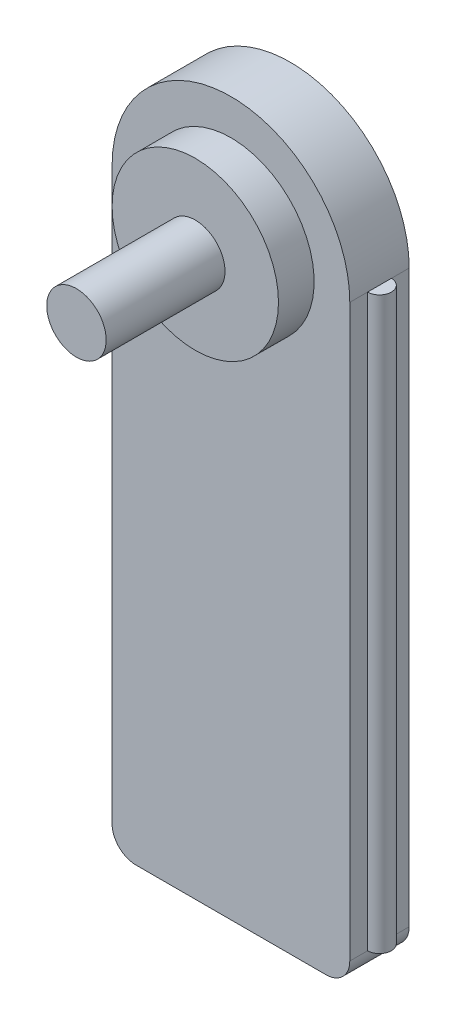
ISO-10303-21;
HEADER;
FILE_DESCRIPTION(('STEP AP214'),'2;1');
FILE_NAME('part.step','',(''),(''),'','','');
FILE_SCHEMA(('AUTOMOTIVE_DESIGN { 1 0 10303 214 1 1 1 1 }'));
ENDSEC;
DATA;
#1=APPLICATION_CONTEXT('core data for automotive mechanical design processes');
#2=APPLICATION_PROTOCOL_DEFINITION('international standard','automotive_design',2000,#1);
#3=PRODUCT_CONTEXT('',#1,'mechanical');
#4=PRODUCT('Part','Part','',(#3));
#5=PRODUCT_RELATED_PRODUCT_CATEGORY('part','',(#4));
#6=PRODUCT_DEFINITION_FORMATION('','',#4);
#7=PRODUCT_DEFINITION_CONTEXT('part definition',#1,'design');
#8=PRODUCT_DEFINITION('design','',#6,#7);
#9=PRODUCT_DEFINITION_SHAPE('','',#8);
#10=(LENGTH_UNIT() NAMED_UNIT(*) SI_UNIT(.MILLI.,.METRE.));
#11=(NAMED_UNIT(*) PLANE_ANGLE_UNIT() SI_UNIT($,.RADIAN.));
#12=(NAMED_UNIT(*) SI_UNIT($,.STERADIAN.) SOLID_ANGLE_UNIT());
#13=UNCERTAINTY_MEASURE_WITH_UNIT(LENGTH_MEASURE(1.E-05),#10,'distance_accuracy_value','');
#14=(GEOMETRIC_REPRESENTATION_CONTEXT(3) GLOBAL_UNCERTAINTY_ASSIGNED_CONTEXT((#13)) GLOBAL_UNIT_ASSIGNED_CONTEXT((#10,
#11,#12)) REPRESENTATION_CONTEXT('',''));
#15=CARTESIAN_POINT('',(0.,0.,0.));
#16=DIRECTION('',(0.,0.,1.));
#17=DIRECTION('',(1.,0.,0.));
#18=AXIS2_PLACEMENT_3D('',#15,#16,#17);
#19=CARTESIAN_POINT('',(-10.,0.,5.));
#20=DIRECTION('',(1.,0.,0.));
#21=DIRECTION('',(0.,1.,0.));
#22=AXIS2_PLACEMENT_3D('',#19,#20,#21);
#23=PLANE('',#22);
#24=DIRECTION('',(0.,1.,0.));
#25=VECTOR('',#24,1.);
#26=CARTESIAN_POINT('',(-9.99999999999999,-48.,1.5));
#27=LINE('',#26,#25);
#28=CARTESIAN_POINT('',(-10.,0.,1.5));
#29=VERTEX_POINT('',#28);
#30=CARTESIAN_POINT('',(-9.99999999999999,-48.,1.5));
#31=VERTEX_POINT('',#30);
#32=EDGE_CURVE('E11',#29,#31,#27,.F.);
#33=ORIENTED_EDGE('',*,*,#32,.F.);
#34=DIRECTION('',(0.,0.,-1.));
#35=VECTOR('',#34,1.);
#36=CARTESIAN_POINT('',(-10.,0.,5.));
#37=LINE('',#36,#35);
#38=CARTESIAN_POINT('',(-10.,0.,0.));
#39=VERTEX_POINT('',#38);
#40=EDGE_CURVE('E136',#29,#39,#37,.T.);
#41=ORIENTED_EDGE('',*,*,#40,.T.);
#42=DIRECTION('',(0.,-1.,0.));
#43=VECTOR('',#42,1.);
#44=CARTESIAN_POINT('',(-10.,0.,0.));
#45=LINE('',#44,#43);
#46=CARTESIAN_POINT('',(-9.99999999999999,-48.,0.));
#47=VERTEX_POINT('',#46);
#48=EDGE_CURVE('E171',#39,#47,#45,.T.);
#49=ORIENTED_EDGE('',*,*,#48,.T.);
#50=DIRECTION('',(0.,0.,-1.));
#51=VECTOR('',#50,1.);
#52=CARTESIAN_POINT('',(-9.99999999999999,-48.,5.));
#53=LINE('',#52,#51);
#54=EDGE_CURVE('E114',#31,#47,#53,.T.);
#55=ORIENTED_EDGE('',*,*,#54,.F.);
#56=EDGE_LOOP('',(#33,#41,#49,#55));
#57=FACE_BOUND('',#56,.T.);
#58=ADVANCED_FACE('F35',(#57),#23,.F.);
#59=DIRECTION('',(0.,1.,0.));
#60=VECTOR('',#59,1.);
#61=CARTESIAN_POINT('',(-9.99999999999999,-48.,3.5));
#62=LINE('',#61,#60);
#63=CARTESIAN_POINT('',(-9.99999999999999,-48.,3.5));
#64=VERTEX_POINT('',#63);
#65=CARTESIAN_POINT('',(-10.,0.,3.5));
#66=VERTEX_POINT('',#65);
#67=EDGE_CURVE('E43',#64,#66,#62,.T.);
#68=ORIENTED_EDGE('',*,*,#67,.F.);
#69=CARTESIAN_POINT('',(-9.99999999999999,-48.,5.));
#70=VERTEX_POINT('',#69);
#71=EDGE_CURVE('E113',#70,#64,#53,.T.);
#72=ORIENTED_EDGE('',*,*,#71,.F.);
#73=DIRECTION('',(0.,-1.,0.));
#74=VECTOR('',#73,1.);
#75=CARTESIAN_POINT('',(-10.,0.,5.));
#76=LINE('',#75,#74);
#77=CARTESIAN_POINT('',(-10.,0.,5.));
#78=VERTEX_POINT('',#77);
#79=EDGE_CURVE('E184',#78,#70,#76,.T.);
#80=ORIENTED_EDGE('',*,*,#79,.F.);
#81=EDGE_CURVE('E131',#78,#66,#37,.T.);
#82=ORIENTED_EDGE('',*,*,#81,.T.);
#83=EDGE_LOOP('',(#68,#72,#80,#82));
#84=FACE_BOUND('',#83,.T.);
#85=ADVANCED_FACE('F128',(#84),#23,.F.);
#86=CARTESIAN_POINT('',(10.,-48.,5.));
#87=DIRECTION('',(-1.,0.,0.));
#88=DIRECTION('',(0.,0.,1.));
#89=AXIS2_PLACEMENT_3D('',#86,#87,#88);
#90=PLANE('',#89);
#91=DIRECTION('',(0.,0.,-1.));
#92=VECTOR('',#91,1.);
#93=CARTESIAN_POINT('',(10.,-48.,5.));
#94=LINE('',#93,#92);
#95=CARTESIAN_POINT('',(10.,-48.,5.));
#96=VERTEX_POINT('',#95);
#97=CARTESIAN_POINT('',(10.,-48.,3.5));
#98=VERTEX_POINT('',#97);
#99=EDGE_CURVE('E148',#96,#98,#94,.T.);
#100=ORIENTED_EDGE('',*,*,#99,.T.);
#101=DIRECTION('',(0.,1.,0.));
#102=VECTOR('',#101,1.);
#103=CARTESIAN_POINT('',(10.,-48.,3.5));
#104=LINE('',#103,#102);
#105=CARTESIAN_POINT('',(10.,0.,3.5));
#106=VERTEX_POINT('',#105);
#107=EDGE_CURVE('E132',#98,#106,#104,.T.);
#108=ORIENTED_EDGE('',*,*,#107,.T.);
#109=DIRECTION('',(0.,0.,-1.));
#110=VECTOR('',#109,1.);
#111=CARTESIAN_POINT('',(10.,0.,5.));
#112=LINE('',#111,#110);
#113=CARTESIAN_POINT('',(10.,0.,5.));
#114=VERTEX_POINT('',#113);
#115=EDGE_CURVE('E155',#114,#106,#112,.T.);
#116=ORIENTED_EDGE('',*,*,#115,.F.);
#117=DIRECTION('',(0.,1.,0.));
#118=VECTOR('',#117,1.);
#119=CARTESIAN_POINT('',(10.,-48.,5.));
#120=LINE('',#119,#118);
#121=EDGE_CURVE('E177',#96,#114,#120,.T.);
#122=ORIENTED_EDGE('',*,*,#121,.F.);
#123=EDGE_LOOP('',(#100,#108,#116,#122));
#124=FACE_BOUND('',#123,.T.);
#125=ADVANCED_FACE('F233',(#124),#90,.F.);
#126=CARTESIAN_POINT('',(0.,0.,8.));
#127=DIRECTION('',(0.,0.,1.));
#128=DIRECTION('',(1.,0.,0.));
#129=AXIS2_PLACEMENT_3D('',#126,#127,#128);
#130=PLANE('',#129);
#131=CARTESIAN_POINT('',(0.,0.,8.));
#132=DIRECTION('',(0.,0.,1.));
#133=DIRECTION('',(1.,0.,0.));
#134=AXIS2_PLACEMENT_3D('',#131,#132,#133);
#135=CIRCLE('',#134,7.);
#136=CARTESIAN_POINT('',(7.,0.,8.));
#137=VERTEX_POINT('',#136);
#138=EDGE_CURVE('E176',#137,#137,#135,.T.);
#139=ORIENTED_EDGE('',*,*,#138,.T.);
#140=EDGE_LOOP('',(#139));
#141=FACE_BOUND('',#140,.T.);
#142=CARTESIAN_POINT('',(0.,0.,8.));
#143=DIRECTION('',(0.,0.,1.));
#144=DIRECTION('',(1.,0.,0.));
#145=AXIS2_PLACEMENT_3D('',#142,#143,#144);
#146=CIRCLE('',#145,2.5);
#147=CARTESIAN_POINT('',(2.5,0.,8.));
#148=VERTEX_POINT('',#147);
#149=EDGE_CURVE('E191',#148,#148,#146,.T.);
#150=ORIENTED_EDGE('',*,*,#149,.F.);
#151=EDGE_LOOP('',(#150));
#152=FACE_BOUND('',#151,.T.);
#153=ADVANCED_FACE('F275',(#141,#152),#130,.T.);
#154=CARTESIAN_POINT('',(0.,0.,5.));
#155=DIRECTION('',(0.,0.,-1.));
#156=DIRECTION('',(-1.,0.,0.));
#157=AXIS2_PLACEMENT_3D('',#154,#155,#156);
#158=PLANE('',#157);
#159=CARTESIAN_POINT('',(0.,0.,5.));
#160=DIRECTION('',(0.,0.,1.));
#161=DIRECTION('',(-1.,0.,0.));
#162=AXIS2_PLACEMENT_3D('',#159,#160,#161);
#163=CIRCLE('',#162,10.);
#164=EDGE_CURVE('E163',#114,#78,#163,.T.);
#165=ORIENTED_EDGE('',*,*,#164,.T.);
#166=ORIENTED_EDGE('',*,*,#79,.T.);
#167=CARTESIAN_POINT('',(-7.99999999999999,-48.,5.));
#168=DIRECTION('',(0.,0.,1.));
#169=DIRECTION('',(1.,0.,0.));
#170=AXIS2_PLACEMENT_3D('',#167,#168,#169);
#171=CIRCLE('',#170,2.);
#172=CARTESIAN_POINT('',(-7.99999999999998,-50.,5.));
#173=VERTEX_POINT('',#172);
#174=EDGE_CURVE('E135',#70,#173,#171,.T.);
#175=ORIENTED_EDGE('',*,*,#174,.T.);
#176=DIRECTION('',(1.,0.,0.));
#177=VECTOR('',#176,1.);
#178=CARTESIAN_POINT('',(-7.99999999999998,-50.,5.));
#179=LINE('',#178,#177);
#180=CARTESIAN_POINT('',(7.99999999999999,-50.,5.));
#181=VERTEX_POINT('',#180);
#182=EDGE_CURVE('E181',#173,#181,#179,.T.);
#183=ORIENTED_EDGE('',*,*,#182,.T.);
#184=CARTESIAN_POINT('',(8.,-48.,5.));
#185=DIRECTION('',(0.,0.,1.));
#186=DIRECTION('',(1.,0.,0.));
#187=AXIS2_PLACEMENT_3D('',#184,#185,#186);
#188=CIRCLE('',#187,2.);
#189=EDGE_CURVE('E179',#181,#96,#188,.T.);
#190=ORIENTED_EDGE('',*,*,#189,.T.);
#191=ORIENTED_EDGE('',*,*,#121,.T.);
#192=EDGE_LOOP('',(#165,#166,#175,#183,#190,#191));
#193=FACE_BOUND('',#192,.T.);
#194=CARTESIAN_POINT('',(0.,0.,5.));
#195=DIRECTION('',(0.,0.,-1.));
#196=DIRECTION('',(-1.,0.,0.));
#197=AXIS2_PLACEMENT_3D('',#194,#195,#196);
#198=CIRCLE('',#197,7.);
#199=CARTESIAN_POINT('',(-7.,0.,5.));
#200=VERTEX_POINT('',#199);
#201=EDGE_CURVE('E224',#200,#200,#198,.F.);
#202=ORIENTED_EDGE('',*,*,#201,.F.);
#203=EDGE_LOOP('',(#202));
#204=FACE_BOUND('',#203,.T.);
#205=ADVANCED_FACE('F218',(#193,#204),#158,.F.);
#206=CARTESIAN_POINT('',(0.,0.,5.));
#207=DIRECTION('',(0.,0.,-1.));
#208=DIRECTION('',(-1.,0.,0.));
#209=AXIS2_PLACEMENT_3D('',#206,#207,#208);
#210=CYLINDRICAL_SURFACE('',#209,10.);
#211=CARTESIAN_POINT('',(0.,0.,0.));
#212=DIRECTION('',(0.,0.,1.));
#213=DIRECTION('',(-1.,0.,0.));
#214=AXIS2_PLACEMENT_3D('',#211,#212,#213);
#215=CIRCLE('',#214,10.);
#216=CARTESIAN_POINT('',(10.,0.,0.));
#217=VERTEX_POINT('',#216);
#218=EDGE_CURVE('E173',#217,#39,#215,.T.);
#219=ORIENTED_EDGE('',*,*,#218,.T.);
#220=ORIENTED_EDGE('',*,*,#40,.F.);
#221=EDGE_CURVE('E137',#66,#29,#37,.T.);
#222=ORIENTED_EDGE('',*,*,#221,.F.);
#223=ORIENTED_EDGE('',*,*,#81,.F.);
#224=ORIENTED_EDGE('',*,*,#164,.F.);
#225=ORIENTED_EDGE('',*,*,#115,.T.);
#226=CARTESIAN_POINT('',(10.,0.,1.5));
#227=VERTEX_POINT('',#226);
#228=EDGE_CURVE('E158',#106,#227,#112,.T.);
#229=ORIENTED_EDGE('',*,*,#228,.T.);
#230=EDGE_CURVE('E159',#227,#217,#112,.T.);
#231=ORIENTED_EDGE('',*,*,#230,.T.);
#232=EDGE_LOOP('',(#219,#220,#222,#223,#224,#225,#229,#231));
#233=FACE_BOUND('',#232,.T.);
#234=ADVANCED_FACE('F37',(#233),#210,.T.);
#235=CARTESIAN_POINT('',(-7.99999999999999,-48.,5.));
#236=DIRECTION('',(0.,0.,-1.));
#237=DIRECTION('',(-1.,0.,0.));
#238=AXIS2_PLACEMENT_3D('',#235,#236,#237);
#239=CYLINDRICAL_SURFACE('',#238,2.);
#240=CARTESIAN_POINT('',(-7.99999999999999,-48.,0.));
#241=DIRECTION('',(0.,0.,1.));
#242=DIRECTION('',(1.,0.,0.));
#243=AXIS2_PLACEMENT_3D('',#240,#241,#242);
#244=CIRCLE('',#243,2.);
#245=CARTESIAN_POINT('',(-7.99999999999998,-50.,0.));
#246=VERTEX_POINT('',#245);
#247=EDGE_CURVE('E169',#47,#246,#244,.T.);
#248=ORIENTED_EDGE('',*,*,#247,.T.);
#249=DIRECTION('',(0.,0.,-1.));
#250=VECTOR('',#249,1.);
#251=CARTESIAN_POINT('',(-7.99999999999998,-50.,5.));
#252=LINE('',#251,#250);
#253=EDGE_CURVE('E140',#173,#246,#252,.T.);
#254=ORIENTED_EDGE('',*,*,#253,.F.);
#255=ORIENTED_EDGE('',*,*,#174,.F.);
#256=ORIENTED_EDGE('',*,*,#71,.T.);
#257=EDGE_CURVE('E109',#64,#31,#53,.T.);
#258=ORIENTED_EDGE('',*,*,#257,.T.);
#259=ORIENTED_EDGE('',*,*,#54,.T.);
#260=EDGE_LOOP('',(#248,#254,#255,#256,#258,#259));
#261=FACE_BOUND('',#260,.T.);
#262=ADVANCED_FACE('F133',(#261),#239,.T.);
#263=CARTESIAN_POINT('',(-7.99999999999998,-50.,5.));
#264=DIRECTION('',(0.,1.,0.));
#265=DIRECTION('',(0.,0.,1.));
#266=AXIS2_PLACEMENT_3D('',#263,#264,#265);
#267=PLANE('',#266);
#268=DIRECTION('',(1.,0.,0.));
#269=VECTOR('',#268,1.);
#270=CARTESIAN_POINT('',(-7.99999999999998,-50.,0.));
#271=LINE('',#270,#269);
#272=CARTESIAN_POINT('',(7.99999999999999,-50.,0.));
#273=VERTEX_POINT('',#272);
#274=EDGE_CURVE('E167',#246,#273,#271,.T.);
#275=ORIENTED_EDGE('',*,*,#274,.T.);
#276=DIRECTION('',(0.,0.,-1.));
#277=VECTOR('',#276,1.);
#278=CARTESIAN_POINT('',(7.99999999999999,-50.,5.));
#279=LINE('',#278,#277);
#280=EDGE_CURVE('E143',#181,#273,#279,.T.);
#281=ORIENTED_EDGE('',*,*,#280,.F.);
#282=ORIENTED_EDGE('',*,*,#182,.F.);
#283=ORIENTED_EDGE('',*,*,#253,.T.);
#284=EDGE_LOOP('',(#275,#281,#282,#283));
#285=FACE_BOUND('',#284,.T.);
#286=ADVANCED_FACE('F215',(#285),#267,.F.);
#287=CARTESIAN_POINT('',(8.,-48.,5.));
#288=DIRECTION('',(0.,0.,-1.));
#289=DIRECTION('',(-1.,0.,0.));
#290=AXIS2_PLACEMENT_3D('',#287,#288,#289);
#291=CYLINDRICAL_SURFACE('',#290,2.);
#292=CARTESIAN_POINT('',(8.,-48.,0.));
#293=DIRECTION('',(0.,0.,1.));
#294=DIRECTION('',(1.,0.,0.));
#295=AXIS2_PLACEMENT_3D('',#292,#293,#294);
#296=CIRCLE('',#295,2.);
#297=CARTESIAN_POINT('',(10.,-48.,0.));
#298=VERTEX_POINT('',#297);
#299=EDGE_CURVE('E164',#273,#298,#296,.T.);
#300=ORIENTED_EDGE('',*,*,#299,.T.);
#301=CARTESIAN_POINT('',(10.,-48.,1.5));
#302=VERTEX_POINT('',#301);
#303=EDGE_CURVE('E154',#302,#298,#94,.T.);
#304=ORIENTED_EDGE('',*,*,#303,.F.);
#305=EDGE_CURVE('E153',#98,#302,#94,.T.);
#306=ORIENTED_EDGE('',*,*,#305,.F.);
#307=ORIENTED_EDGE('',*,*,#99,.F.);
#308=ORIENTED_EDGE('',*,*,#189,.F.);
#309=ORIENTED_EDGE('',*,*,#280,.T.);
#310=EDGE_LOOP('',(#300,#304,#306,#307,#308,#309));
#311=FACE_BOUND('',#310,.T.);
#312=ADVANCED_FACE('F243',(#311),#291,.T.);
#313=ORIENTED_EDGE('',*,*,#230,.F.);
#314=DIRECTION('',(0.,1.,0.));
#315=VECTOR('',#314,1.);
#316=CARTESIAN_POINT('',(10.,-48.,1.5));
#317=LINE('',#316,#315);
#318=EDGE_CURVE('E226',#227,#302,#317,.F.);
#319=ORIENTED_EDGE('',*,*,#318,.T.);
#320=ORIENTED_EDGE('',*,*,#303,.T.);
#321=DIRECTION('',(0.,1.,0.));
#322=VECTOR('',#321,1.);
#323=CARTESIAN_POINT('',(10.,-48.,0.));
#324=LINE('',#323,#322);
#325=EDGE_CURVE('E160',#298,#217,#324,.T.);
#326=ORIENTED_EDGE('',*,*,#325,.T.);
#327=EDGE_LOOP('',(#313,#319,#320,#326));
#328=FACE_BOUND('',#327,.T.);
#329=ADVANCED_FACE('F240',(#328),#90,.F.);
#330=CARTESIAN_POINT('',(0.,0.,0.));
#331=DIRECTION('',(0.,0.,-1.));
#332=DIRECTION('',(-1.,0.,0.));
#333=AXIS2_PLACEMENT_3D('',#330,#331,#332);
#334=PLANE('',#333);
#335=ORIENTED_EDGE('',*,*,#218,.F.);
#336=ORIENTED_EDGE('',*,*,#325,.F.);
#337=ORIENTED_EDGE('',*,*,#299,.F.);
#338=ORIENTED_EDGE('',*,*,#274,.F.);
#339=ORIENTED_EDGE('',*,*,#247,.F.);
#340=ORIENTED_EDGE('',*,*,#48,.F.);
#341=EDGE_LOOP('',(#335,#336,#337,#338,#339,#340));
#342=FACE_BOUND('',#341,.T.);
#343=ADVANCED_FACE('F211',(#342),#334,.T.);
#344=CARTESIAN_POINT('',(0.,0.,8.));
#345=DIRECTION('',(0.,0.,-1.));
#346=DIRECTION('',(-1.,0.,0.));
#347=AXIS2_PLACEMENT_3D('',#344,#345,#346);
#348=CYLINDRICAL_SURFACE('',#347,7.);
#349=ORIENTED_EDGE('',*,*,#138,.F.);
#350=EDGE_LOOP('',(#349));
#351=FACE_BOUND('',#350,.T.);
#352=ORIENTED_EDGE('',*,*,#201,.T.);
#353=EDGE_LOOP('',(#352));
#354=FACE_BOUND('',#353,.T.);
#355=ADVANCED_FACE('F272',(#351,#354),#348,.T.);
#356=CARTESIAN_POINT('',(0.,0.,18.));
#357=DIRECTION('',(0.,0.,-1.));
#358=DIRECTION('',(-1.,0.,0.));
#359=AXIS2_PLACEMENT_3D('',#356,#357,#358);
#360=CYLINDRICAL_SURFACE('',#359,2.5);
#361=CARTESIAN_POINT('',(0.,0.,18.));
#362=DIRECTION('',(0.,0.,1.));
#363=DIRECTION('',(1.,0.,0.));
#364=AXIS2_PLACEMENT_3D('',#361,#362,#363);
#365=CIRCLE('',#364,2.5);
#366=CARTESIAN_POINT('',(2.5,0.,18.));
#367=VERTEX_POINT('',#366);
#368=EDGE_CURVE('E190',#367,#367,#365,.T.);
#369=ORIENTED_EDGE('',*,*,#368,.F.);
#370=EDGE_LOOP('',(#369));
#371=FACE_BOUND('',#370,.T.);
#372=ORIENTED_EDGE('',*,*,#149,.T.);
#373=EDGE_LOOP('',(#372));
#374=FACE_BOUND('',#373,.T.);
#375=ADVANCED_FACE('F278',(#371,#374),#360,.T.);
#376=CARTESIAN_POINT('',(0.,0.,18.));
#377=DIRECTION('',(0.,0.,1.));
#378=DIRECTION('',(1.,0.,0.));
#379=AXIS2_PLACEMENT_3D('',#376,#377,#378);
#380=PLANE('',#379);
#381=ORIENTED_EDGE('',*,*,#368,.T.);
#382=EDGE_LOOP('',(#381));
#383=FACE_BOUND('',#382,.T.);
#384=ADVANCED_FACE('F253',(#383),#380,.T.);
#385=CARTESIAN_POINT('',(10.,-48.,2.5));
#386=DIRECTION('',(0.,1.,0.));
#387=DIRECTION('',(0.,0.,1.));
#388=AXIS2_PLACEMENT_3D('',#385,#386,#387);
#389=CYLINDRICAL_SURFACE('',#388,1.);
#390=ORIENTED_EDGE('',*,*,#107,.F.);
#391=CARTESIAN_POINT('',(10.,-48.,2.5));
#392=DIRECTION('',(0.,1.,0.));
#393=DIRECTION('',(0.,0.,1.));
#394=AXIS2_PLACEMENT_3D('',#391,#392,#393);
#395=CIRCLE('',#394,1.);
#396=EDGE_CURVE('E194',#98,#302,#395,.T.);
#397=ORIENTED_EDGE('',*,*,#396,.T.);
#398=ORIENTED_EDGE('',*,*,#318,.F.);
#399=CARTESIAN_POINT('',(10.,0.,2.5));
#400=DIRECTION('',(0.,1.,0.));
#401=DIRECTION('',(0.,0.,1.));
#402=AXIS2_PLACEMENT_3D('',#399,#400,#401);
#403=CIRCLE('',#402,1.);
#404=EDGE_CURVE('E55',#106,#227,#403,.T.);
#405=ORIENTED_EDGE('',*,*,#404,.F.);
#406=EDGE_LOOP('',(#390,#397,#398,#405));
#407=FACE_BOUND('',#406,.T.);
#408=ADVANCED_FACE('F237',(#407),#389,.T.);
#409=CARTESIAN_POINT('',(10.,-48.,2.5));
#410=DIRECTION('',(0.,1.,0.));
#411=DIRECTION('',(0.,0.,1.));
#412=AXIS2_PLACEMENT_3D('',#409,#410,#411);
#413=PLANE('',#412);
#414=ORIENTED_EDGE('',*,*,#396,.F.);
#415=ORIENTED_EDGE('',*,*,#305,.T.);
#416=EDGE_LOOP('',(#414,#415));
#417=FACE_BOUND('',#416,.T.);
#418=ADVANCED_FACE('F245',(#417),#413,.F.);
#419=CARTESIAN_POINT('',(10.,0.,2.5));
#420=DIRECTION('',(0.,1.,0.));
#421=DIRECTION('',(0.,0.,1.));
#422=AXIS2_PLACEMENT_3D('',#419,#420,#421);
#423=PLANE('',#422);
#424=ORIENTED_EDGE('',*,*,#228,.F.);
#425=ORIENTED_EDGE('',*,*,#404,.T.);
#426=EDGE_LOOP('',(#424,#425));
#427=FACE_BOUND('',#426,.T.);
#428=ADVANCED_FACE('F236',(#427),#423,.T.);
#429=CARTESIAN_POINT('',(-10.,-48.,2.5));
#430=DIRECTION('',(0.,1.,0.));
#431=DIRECTION('',(0.,0.,1.));
#432=AXIS2_PLACEMENT_3D('',#429,#430,#431);
#433=CYLINDRICAL_SURFACE('',#432,1.);
#434=CARTESIAN_POINT('',(-10.,0.,2.5));
#435=DIRECTION('',(0.,-1.,0.));
#436=DIRECTION('',(0.,0.,1.));
#437=AXIS2_PLACEMENT_3D('',#434,#435,#436);
#438=CIRCLE('',#437,1.);
#439=EDGE_CURVE('E123',#66,#29,#438,.T.);
#440=ORIENTED_EDGE('',*,*,#439,.T.);
#441=ORIENTED_EDGE('',*,*,#32,.T.);
#442=CARTESIAN_POINT('',(-10.,-48.,2.5));
#443=DIRECTION('',(0.,-1.,0.));
#444=DIRECTION('',(0.,0.,1.));
#445=AXIS2_PLACEMENT_3D('',#442,#443,#444);
#446=CIRCLE('',#445,1.);
#447=EDGE_CURVE('E49',#64,#31,#446,.T.);
#448=ORIENTED_EDGE('',*,*,#447,.F.);
#449=ORIENTED_EDGE('',*,*,#67,.T.);
#450=EDGE_LOOP('',(#440,#441,#448,#449));
#451=FACE_BOUND('',#450,.T.);
#452=ADVANCED_FACE('F119',(#451),#433,.T.);
#453=CARTESIAN_POINT('',(-10.,0.,2.5));
#454=DIRECTION('',(0.,1.,0.));
#455=DIRECTION('',(0.,0.,1.));
#456=AXIS2_PLACEMENT_3D('',#453,#454,#455);
#457=PLANE('',#456);
#458=ORIENTED_EDGE('',*,*,#221,.T.);
#459=ORIENTED_EDGE('',*,*,#439,.F.);
#460=EDGE_LOOP('',(#458,#459));
#461=FACE_BOUND('',#460,.T.);
#462=ADVANCED_FACE('F335',(#461),#457,.T.);
#463=CARTESIAN_POINT('',(-10.,-48.,2.5));
#464=DIRECTION('',(0.,1.,0.));
#465=DIRECTION('',(0.,0.,1.));
#466=AXIS2_PLACEMENT_3D('',#463,#464,#465);
#467=PLANE('',#466);
#468=ORIENTED_EDGE('',*,*,#447,.T.);
#469=ORIENTED_EDGE('',*,*,#257,.F.);
#470=EDGE_LOOP('',(#468,#469));
#471=FACE_BOUND('',#470,.T.);
#472=ADVANCED_FACE('F110',(#471),#467,.F.);
#473=CLOSED_SHELL('',(#58,#85,#125,#153,#205,#234,#262,#286,#312,#329,#343,#355,#375,#384,#408,
#418,#428,#452,#462,#472));
#474=MANIFOLD_SOLID_BREP('B2',#473);
#475=ADVANCED_BREP_SHAPE_REPRESENTATION('',(#18,#474),#14);
#476=SHAPE_DEFINITION_REPRESENTATION(#9,#475);
ENDSEC;
END-ISO-10303-21;
